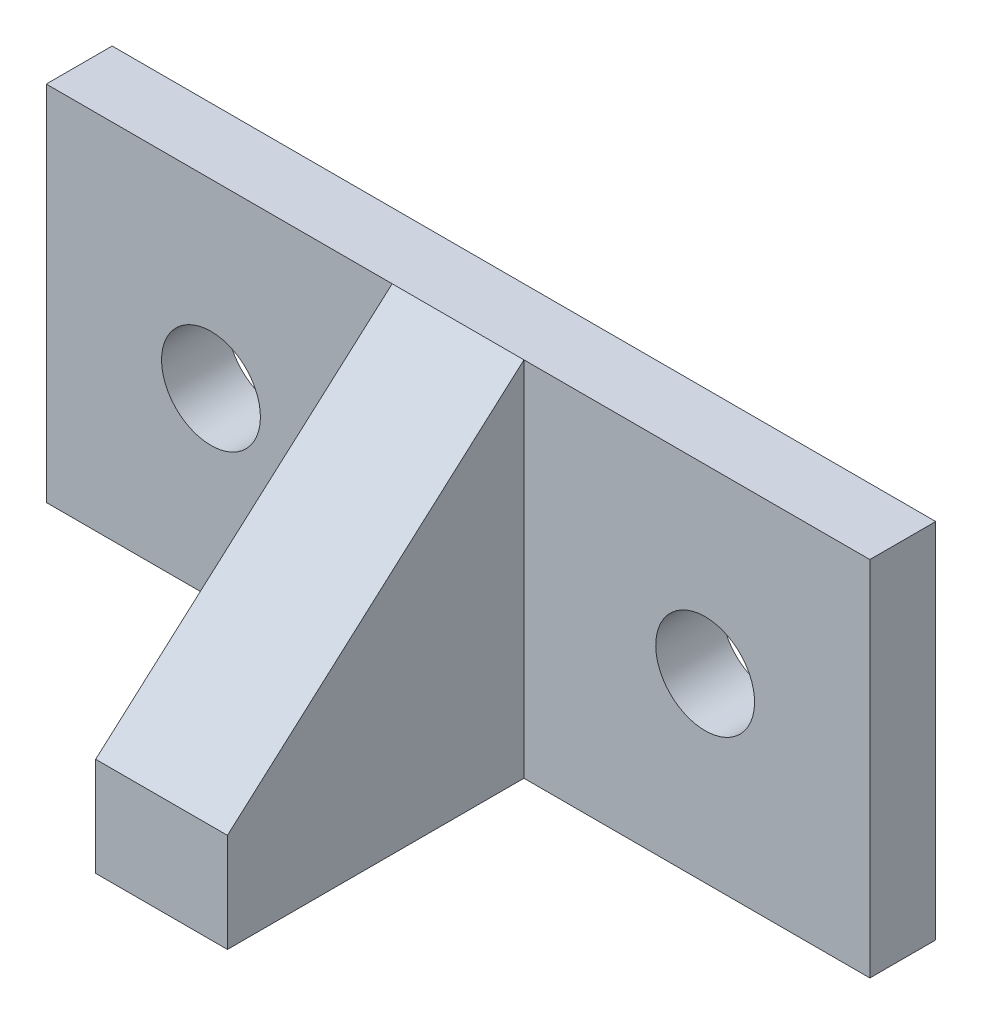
from build123d import *

# Parameters (mm, degrees)
SKETCH1_W           = 125
SKETCH1_H           = 55
SKETCH1_R           = 7.5
BOSS_EXTRUDE1_DEPTH = 55
SKETCH2_W           = 45
SKETCH2_H           = 55
CUT_EXTRUDE4_DEPTH  = 52.5
SKETCH3_W           = 45
SKETCH3_H           = 55
CUT_EXTRUDE5_DEPTH  = 52.5
CUT_EXTRUDE6_DEPTH  = 96.065766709


with BuildPart() as part:
    # Sketch1 → Boss-Extrude1 (new body)
    with BuildSketch(Plane.XY):
        Rectangle(SKETCH1_W, SKETCH1_H)
        with Locations((-37.5, 0)):
            Circle(SKETCH1_R, mode=Mode.SUBTRACT)
        with Locations((37.5, 0)):
            Circle(SKETCH1_R, mode=Mode.SUBTRACT)
    extrude(amount=BOSS_EXTRUDE1_DEPTH)

    # Sketch2 → Cut-Extrude4 (cut)
    with BuildSketch(Plane(origin=(62.5, 0, 0), x_dir=(0, 0, -1), z_dir=(1, 0, 0))):
        with Locations((-32.5, 0)):
            Rectangle(SKETCH2_W, SKETCH2_H)
    extrude(amount=-CUT_EXTRUDE4_DEPTH, mode=Mode.SUBTRACT)

    # Sketch3 → Cut-Extrude5 (cut)
    with BuildSketch(Plane.ZY.offset(62.5)):
        with Locations((32.5, 0)):
            Rectangle(SKETCH3_W, SKETCH3_H)
    extrude(amount=-CUT_EXTRUDE5_DEPTH, mode=Mode.SUBTRACT)

    # Sketch4 → Cut-Extrude6 (cut, through all)
    with BuildSketch(Plane(origin=(10, 0, 0), x_dir=(0, 0, -1), z_dir=(1, 0, 0))):
        Polygon((-55, 27.5), (-55, -12.5), (-10, 27.5), align=None)
    extrude(amount=-CUT_EXTRUDE6_DEPTH, mode=Mode.SUBTRACT)


solid = part.part
